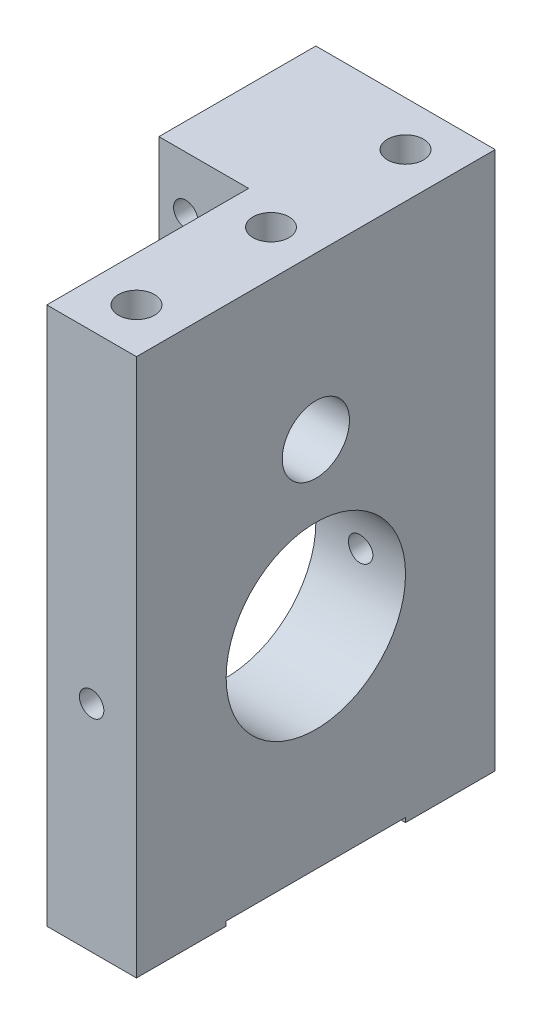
from build123d import *

# Parameters (mm, degrees)
SKETCH1_W                   = 50.8
SKETCH1_H                   = 76.2
BOSS_EXTRUDE1_DEPTH         = 6.35
F_1_4_20_TAPPED_HOLE1_D     = 5.1054
F_1_4_20_TAPPED_HOLE1_DEPTH = 19.05
F_1_4_20_TAPPED_HOLE1_TIP   = 1.533816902
CUT_EXTRUDE1_REACH          = 49.519
SKETCH5_W                   = 25.4
SKETCH5_H                   = 0.635
F_1_4_20_TAPPED_HOLE2_D     = 5.1054
F_1_4_20_TAPPED_HOLE2_DEPTH = 19.05
F_1_4_20_TAPPED_HOLE2_TIP   = 1.533816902
CUT_EXTRUDE2_REACH          = 49.519
SKETCH8_R                   = 12.7
SKETCH9_W                   = 22.225
SKETCH9_H                   = 19.05
BOSS_EXTRUDE2_DEPTH         = 12.7
F_8_32_TAPPED_HOLE1_D       = 3.4544
SKETCH12_R                  = 4.7625
CUT_EXTRUDE3_DEPTH          = 53.363441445
F_8_32_TAPPED_HOLE2_D       = 3.4544


with BuildPart() as part:
    # Sketch1 → Boss-Extrude1 (new, symmetric)
    with BuildSketch(Plane(origin=(0, 0, 0), x_dir=(0, 0, -1), z_dir=(1, 0, 0))):
        Rectangle(SKETCH1_W, SKETCH1_H)
    extrude(amount=BOSS_EXTRUDE1_DEPTH, both=True)

    # 1_4-20 Tapped Hole1
    with Locations(Plane(origin=(0, -38.1, 0), x_dir=(-1, 0, 0), z_dir=(0, -1, 0))):
        with Locations((0, -19.05), (0, 19.05)):
            Hole(F_1_4_20_TAPPED_HOLE1_D / 2, depth=F_1_4_20_TAPPED_HOLE1_DEPTH)
            with Locations((0, 0, -(F_1_4_20_TAPPED_HOLE1_DEPTH + F_1_4_20_TAPPED_HOLE1_TIP / 2))):  # 118° drill point
                Cone(0, F_1_4_20_TAPPED_HOLE1_D / 2, F_1_4_20_TAPPED_HOLE1_TIP, mode=Mode.SUBTRACT)

    # Sketch5 → Cut-Extrude1 (cut, up to next)
    with BuildSketch(Plane(origin=(6.35, 0, 0), x_dir=(0, 0, -1), z_dir=(1, 0, 0)), mode=Mode.PRIVATE) as cut_extrude1_sk1:
        with Locations((0, -37.7825)):
            Rectangle(SKETCH5_W, SKETCH5_H)
    cut_extrude1_tool1 = extrude(cut_extrude1_sk1.sketch, amount=-CUT_EXTRUDE1_REACH, mode=Mode.PRIVATE) & part.part
    add(cut_extrude1_tool1.solids().sort_by_distance((6.35, -37.7825, 0))[0], mode=Mode.SUBTRACT)

    # 1_4-20 Tapped Hole2
    with Locations(Plane(origin=(0, 38.1, 0), x_dir=(1, 0, 0), z_dir=(0, 1, 0))):
        with Locations((0, 19.05), (0, 0), (0, -19.05)):
            Hole(F_1_4_20_TAPPED_HOLE2_D / 2, depth=F_1_4_20_TAPPED_HOLE2_DEPTH)
            with Locations((0, 0, -(F_1_4_20_TAPPED_HOLE2_DEPTH + F_1_4_20_TAPPED_HOLE2_TIP / 2))):  # 118° drill point
                Cone(0, F_1_4_20_TAPPED_HOLE2_D / 2, F_1_4_20_TAPPED_HOLE2_TIP, mode=Mode.SUBTRACT)

    # Sketch8 → Cut-Extrude2 (cut, up to next)
    with BuildSketch(Plane(origin=(6.35, 0, 0), x_dir=(0, 0, -1), z_dir=(1, 0, 0)), mode=Mode.PRIVATE) as cut_extrude2_sk1:
        with Locations((0, -7.62)):
            Circle(SKETCH8_R)
    cut_extrude2_tool1 = extrude(cut_extrude2_sk1.sketch, amount=-CUT_EXTRUDE2_REACH, mode=Mode.PRIVATE) & part.part
    add(cut_extrude2_tool1.solids().sort_by_distance((6.35, -7.62, 0))[0], mode=Mode.SUBTRACT)

    # Sketch9 → Boss-Extrude2 (add)
    with BuildSketch(Plane.ZY.offset(6.35)):
        with Locations((-14.2875, 28.575)):
            Rectangle(SKETCH9_W, SKETCH9_H)
    extrude(amount=BOSS_EXTRUDE2_DEPTH)

    # 8-32 Tapped Hole1 (through all)
    with Locations(Plane.XY.offset(-3.175)):
        with Locations((-15.24, 30.48)):
            Hole(F_8_32_TAPPED_HOLE1_D / 2)

    # Sketch12 → Cut-Extrude3 (cut, through all)
    with BuildSketch(Plane(origin=(6.35, 0, 0), x_dir=(0, 0, -1), z_dir=(1, 0, 0))):
        with Locations((0, 15.24)):
            Circle(SKETCH12_R)
    extrude(amount=-CUT_EXTRUDE3_DEPTH, mode=Mode.SUBTRACT)

    # 8-32 Tapped Hole2 (through all)
    with Locations(Plane.XY.offset(25.4)):
        with Locations((0, -7.62)):
            Hole(F_8_32_TAPPED_HOLE2_D / 2)


solid = part.part
